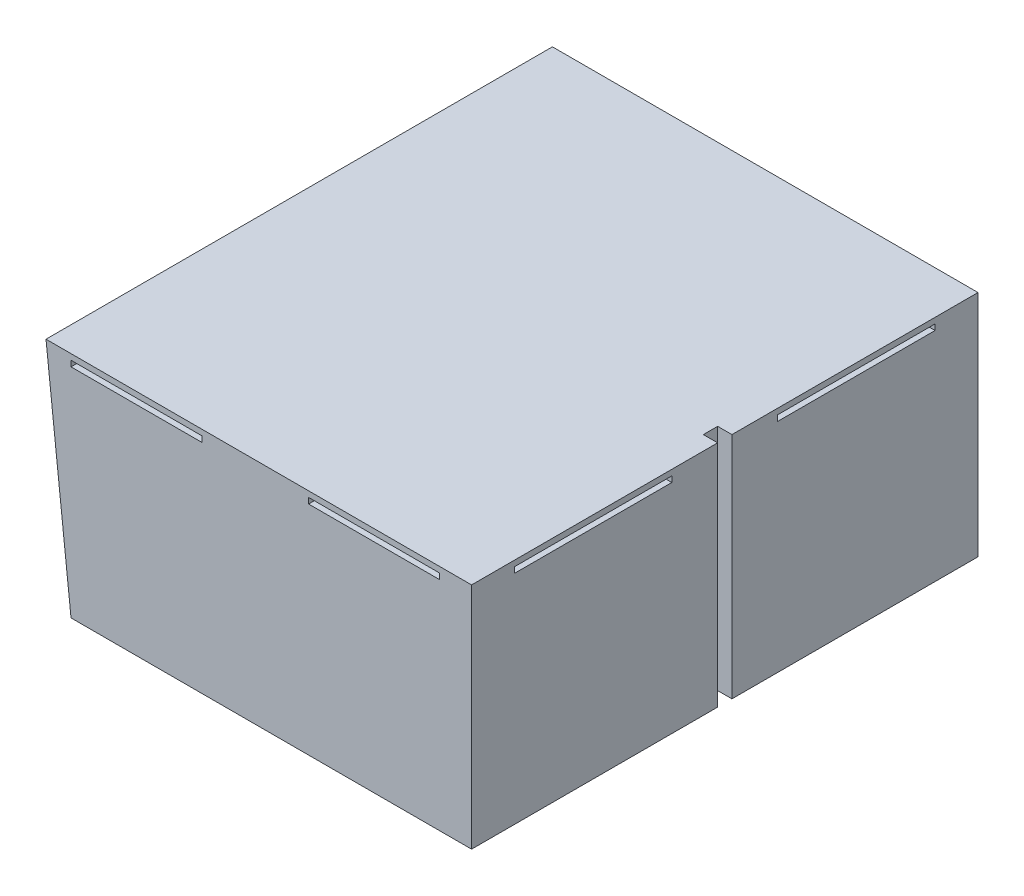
ISO-10303-21;
HEADER;
FILE_DESCRIPTION(('STEP AP214'),'2;1');
FILE_NAME('part.step','',(''),(''),'','','');
FILE_SCHEMA(('AUTOMOTIVE_DESIGN { 1 0 10303 214 1 1 1 1 }'));
ENDSEC;
DATA;
#1=APPLICATION_CONTEXT('core data for automotive mechanical design processes');
#2=APPLICATION_PROTOCOL_DEFINITION('international standard','automotive_design',2000,#1);
#3=PRODUCT_CONTEXT('',#1,'mechanical');
#4=PRODUCT('Part','Part','',(#3));
#5=PRODUCT_RELATED_PRODUCT_CATEGORY('part','',(#4));
#6=PRODUCT_DEFINITION_FORMATION('','',#4);
#7=PRODUCT_DEFINITION_CONTEXT('part definition',#1,'design');
#8=PRODUCT_DEFINITION('design','',#6,#7);
#9=PRODUCT_DEFINITION_SHAPE('','',#8);
#10=(LENGTH_UNIT() NAMED_UNIT(*) SI_UNIT(.MILLI.,.METRE.));
#11=(NAMED_UNIT(*) PLANE_ANGLE_UNIT() SI_UNIT($,.RADIAN.));
#12=(NAMED_UNIT(*) SI_UNIT($,.STERADIAN.) SOLID_ANGLE_UNIT());
#13=UNCERTAINTY_MEASURE_WITH_UNIT(LENGTH_MEASURE(1.E-05),#10,'distance_accuracy_value','');
#14=(GEOMETRIC_REPRESENTATION_CONTEXT(3) GLOBAL_UNCERTAINTY_ASSIGNED_CONTEXT((#13)) GLOBAL_UNIT_ASSIGNED_CONTEXT((#10,
#11,#12)) REPRESENTATION_CONTEXT('',''));
#15=CARTESIAN_POINT('',(0.,0.,0.));
#16=DIRECTION('',(0.,0.,1.));
#17=DIRECTION('',(1.,0.,0.));
#18=AXIS2_PLACEMENT_3D('',#15,#16,#17);
#19=CARTESIAN_POINT('',(1400.,800.,1770.));
#20=DIRECTION('',(-1.,0.,0.));
#21=DIRECTION('',(0.,0.,1.));
#22=AXIS2_PLACEMENT_3D('',#19,#20,#21);
#23=PLANE('',#22);
#24=DIRECTION('',(0.,0.,-1.));
#25=VECTOR('',#24,1.);
#26=CARTESIAN_POINT('',(1400.,760.,1620.));
#27=LINE('',#26,#25);
#28=CARTESIAN_POINT('',(1400.,760.,1620.));
#29=VERTEX_POINT('',#28);
#30=CARTESIAN_POINT('',(1400.,760.,1070.));
#31=VERTEX_POINT('',#30);
#32=EDGE_CURVE('E382',#29,#31,#27,.T.);
#33=ORIENTED_EDGE('',*,*,#32,.F.);
#34=DIRECTION('',(0.,-1.,0.));
#35=VECTOR('',#34,1.);
#36=CARTESIAN_POINT('',(1400.,780.,1620.));
#37=LINE('',#36,#35);
#38=CARTESIAN_POINT('',(1400.,780.,1620.));
#39=VERTEX_POINT('',#38);
#40=EDGE_CURVE('E380',#39,#29,#37,.T.);
#41=ORIENTED_EDGE('',*,*,#40,.F.);
#42=DIRECTION('',(0.,0.,1.));
#43=VECTOR('',#42,1.);
#44=CARTESIAN_POINT('',(1400.,780.,1620.));
#45=LINE('',#44,#43);
#46=CARTESIAN_POINT('',(1400.,780.,1070.));
#47=VERTEX_POINT('',#46);
#48=EDGE_CURVE('E388',#47,#39,#45,.T.);
#49=ORIENTED_EDGE('',*,*,#48,.F.);
#50=DIRECTION('',(0.,1.,0.));
#51=VECTOR('',#50,1.);
#52=CARTESIAN_POINT('',(1400.,780.,1070.));
#53=LINE('',#52,#51);
#54=EDGE_CURVE('E385',#31,#47,#53,.T.);
#55=ORIENTED_EDGE('',*,*,#54,.F.);
#56=EDGE_LOOP('',(#33,#41,#49,#55));
#57=FACE_BOUND('',#56,.T.);
#58=DIRECTION('',(0.,0.,-1.));
#59=VECTOR('',#58,1.);
#60=CARTESIAN_POINT('',(1400.,0.,1770.));
#61=LINE('',#60,#59);
#62=CARTESIAN_POINT('',(1400.,0.,1770.));
#63=VERTEX_POINT('',#62);
#64=CARTESIAN_POINT('',(1400.,0.,910.));
#65=VERTEX_POINT('',#64);
#66=EDGE_CURVE('E559',#63,#65,#61,.T.);
#67=ORIENTED_EDGE('',*,*,#66,.T.);
#68=DIRECTION('',(0.,-1.,0.));
#69=VECTOR('',#68,1.);
#70=CARTESIAN_POINT('',(1400.,800.,910.));
#71=LINE('',#70,#69);
#72=CARTESIAN_POINT('',(1400.,800.,910.));
#73=VERTEX_POINT('',#72);
#74=EDGE_CURVE('E294',#73,#65,#71,.T.);
#75=ORIENTED_EDGE('',*,*,#74,.F.);
#76=DIRECTION('',(0.,0.,-1.));
#77=VECTOR('',#76,1.);
#78=CARTESIAN_POINT('',(1400.,800.,1770.));
#79=LINE('',#78,#77);
#80=CARTESIAN_POINT('',(1400.,800.,1770.));
#81=VERTEX_POINT('',#80);
#82=EDGE_CURVE('E555',#81,#73,#79,.T.);
#83=ORIENTED_EDGE('',*,*,#82,.F.);
#84=DIRECTION('',(0.,1.,0.));
#85=VECTOR('',#84,1.);
#86=CARTESIAN_POINT('',(1400.,800.,1770.));
#87=LINE('',#86,#85);
#88=EDGE_CURVE('E538',#63,#81,#87,.T.);
#89=ORIENTED_EDGE('',*,*,#88,.F.);
#90=EDGE_LOOP('',(#67,#75,#83,#89));
#91=FACE_BOUND('',#90,.T.);
#92=ADVANCED_FACE('F32',(#57,#91),#23,.F.);
#93=CARTESIAN_POINT('',(0.,780.,0.));
#94=DIRECTION('',(-1.,0.,0.));
#95=DIRECTION('',(0.,-1.,0.));
#96=AXIS2_PLACEMENT_3D('',#93,#94,#95);
#97=PLANE('',#96);
#98=DIRECTION('',(0.,0.,1.));
#99=VECTOR('',#98,1.);
#100=CARTESIAN_POINT('',(0.,760.,0.));
#101=LINE('',#100,#99);
#102=CARTESIAN_POINT('',(0.,760.,700.));
#103=VERTEX_POINT('',#102);
#104=CARTESIAN_POINT('',(0.,760.,1070.));
#105=VERTEX_POINT('',#104);
#106=EDGE_CURVE('E531',#103,#105,#101,.T.);
#107=ORIENTED_EDGE('',*,*,#106,.F.);
#108=DIRECTION('',(0.,1.,0.));
#109=VECTOR('',#108,1.);
#110=CARTESIAN_POINT('',(0.,780.,700.));
#111=LINE('',#110,#109);
#112=CARTESIAN_POINT('',(0.,780.,700.));
#113=VERTEX_POINT('',#112);
#114=EDGE_CURVE('E374',#103,#113,#111,.T.);
#115=ORIENTED_EDGE('',*,*,#114,.T.);
#116=DIRECTION('',(0.,0.,1.));
#117=VECTOR('',#116,1.);
#118=CARTESIAN_POINT('',(0.,780.,0.));
#119=LINE('',#118,#117);
#120=CARTESIAN_POINT('',(0.,780.,1070.));
#121=VERTEX_POINT('',#120);
#122=EDGE_CURVE('E517',#113,#121,#119,.T.);
#123=ORIENTED_EDGE('',*,*,#122,.T.);
#124=DIRECTION('',(0.,-1.,0.));
#125=VECTOR('',#124,1.);
#126=CARTESIAN_POINT('',(0.,780.,1070.));
#127=LINE('',#126,#125);
#128=EDGE_CURVE('E417',#121,#105,#127,.T.);
#129=ORIENTED_EDGE('',*,*,#128,.T.);
#130=EDGE_LOOP('',(#107,#115,#123,#129));
#131=FACE_BOUND('',#130,.T.);
#132=ADVANCED_FACE('F658',(#131),#97,.F.);
#133=CARTESIAN_POINT('',(457.431779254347,780.,0.));
#134=DIRECTION('',(1.,0.,0.));
#135=DIRECTION('',(0.,0.,-1.));
#136=AXIS2_PLACEMENT_3D('',#133,#134,#135);
#137=PLANE('',#136);
#138=DIRECTION('',(0.,0.,1.));
#139=VECTOR('',#138,1.);
#140=CARTESIAN_POINT('',(457.431779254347,780.,0.));
#141=LINE('',#140,#139);
#142=CARTESIAN_POINT('',(457.431779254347,780.,700.));
#143=VERTEX_POINT('',#142);
#144=CARTESIAN_POINT('',(457.431779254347,780.,1070.));
#145=VERTEX_POINT('',#144);
#146=EDGE_CURVE('E522',#143,#145,#141,.T.);
#147=ORIENTED_EDGE('',*,*,#146,.F.);
#148=DIRECTION('',(0.,-1.,0.));
#149=VECTOR('',#148,1.);
#150=CARTESIAN_POINT('',(457.431779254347,780.,700.));
#151=LINE('',#150,#149);
#152=CARTESIAN_POINT('',(457.431779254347,760.,700.));
#153=VERTEX_POINT('',#152);
#154=EDGE_CURVE('E371',#143,#153,#151,.T.);
#155=ORIENTED_EDGE('',*,*,#154,.T.);
#156=DIRECTION('',(0.,0.,1.));
#157=VECTOR('',#156,1.);
#158=CARTESIAN_POINT('',(457.431779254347,760.,0.));
#159=LINE('',#158,#157);
#160=CARTESIAN_POINT('',(457.431779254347,760.,1070.));
#161=VERTEX_POINT('',#160);
#162=EDGE_CURVE('E527',#153,#161,#159,.T.);
#163=ORIENTED_EDGE('',*,*,#162,.T.);
#164=DIRECTION('',(0.,1.,0.));
#165=VECTOR('',#164,1.);
#166=CARTESIAN_POINT('',(457.431779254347,780.,1070.));
#167=LINE('',#166,#165);
#168=EDGE_CURVE('E414',#161,#145,#167,.T.);
#169=ORIENTED_EDGE('',*,*,#168,.T.);
#170=EDGE_LOOP('',(#147,#155,#163,#169));
#171=FACE_BOUND('',#170,.T.);
#172=ADVANCED_FACE('F666',(#171),#137,.F.);
#173=CARTESIAN_POINT('',(830.303739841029,780.,0.));
#174=DIRECTION('',(-1.,0.,0.));
#175=DIRECTION('',(0.,0.,1.));
#176=AXIS2_PLACEMENT_3D('',#173,#174,#175);
#177=PLANE('',#176);
#178=DIRECTION('',(0.,0.,1.));
#179=VECTOR('',#178,1.);
#180=CARTESIAN_POINT('',(830.303739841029,760.,0.));
#181=LINE('',#180,#179);
#182=CARTESIAN_POINT('',(830.303739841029,760.,700.));
#183=VERTEX_POINT('',#182);
#184=CARTESIAN_POINT('',(830.303739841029,760.,1070.));
#185=VERTEX_POINT('',#184);
#186=EDGE_CURVE('E488',#183,#185,#181,.T.);
#187=ORIENTED_EDGE('',*,*,#186,.F.);
#188=DIRECTION('',(0.,1.,0.));
#189=VECTOR('',#188,1.);
#190=CARTESIAN_POINT('',(830.303739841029,780.,700.));
#191=LINE('',#190,#189);
#192=CARTESIAN_POINT('',(830.303739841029,780.,700.));
#193=VERTEX_POINT('',#192);
#194=EDGE_CURVE('E368',#183,#193,#191,.T.);
#195=ORIENTED_EDGE('',*,*,#194,.T.);
#196=DIRECTION('',(0.,0.,1.));
#197=VECTOR('',#196,1.);
#198=CARTESIAN_POINT('',(830.303739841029,780.,0.));
#199=LINE('',#198,#197);
#200=CARTESIAN_POINT('',(830.303739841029,780.,1070.));
#201=VERTEX_POINT('',#200);
#202=EDGE_CURVE('E473',#193,#201,#199,.T.);
#203=ORIENTED_EDGE('',*,*,#202,.T.);
#204=DIRECTION('',(0.,-1.,0.));
#205=VECTOR('',#204,1.);
#206=CARTESIAN_POINT('',(830.303739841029,780.,1070.));
#207=LINE('',#206,#205);
#208=EDGE_CURVE('E411',#201,#185,#207,.T.);
#209=ORIENTED_EDGE('',*,*,#208,.T.);
#210=EDGE_LOOP('',(#187,#195,#203,#209));
#211=FACE_BOUND('',#210,.T.);
#212=ADVANCED_FACE('F618',(#211),#177,.F.);
#213=CARTESIAN_POINT('',(1287.73551909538,780.,0.));
#214=DIRECTION('',(1.,0.,0.));
#215=DIRECTION('',(0.,0.,-1.));
#216=AXIS2_PLACEMENT_3D('',#213,#214,#215);
#217=PLANE('',#216);
#218=DIRECTION('',(0.,0.,1.));
#219=VECTOR('',#218,1.);
#220=CARTESIAN_POINT('',(1287.73551909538,780.,0.));
#221=LINE('',#220,#219);
#222=CARTESIAN_POINT('',(1287.73551909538,780.,700.));
#223=VERTEX_POINT('',#222);
#224=CARTESIAN_POINT('',(1287.73551909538,780.,1070.));
#225=VERTEX_POINT('',#224);
#226=EDGE_CURVE('E478',#223,#225,#221,.T.);
#227=ORIENTED_EDGE('',*,*,#226,.F.);
#228=DIRECTION('',(0.,-1.,0.));
#229=VECTOR('',#228,1.);
#230=CARTESIAN_POINT('',(1287.73551909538,780.,700.));
#231=LINE('',#230,#229);
#232=CARTESIAN_POINT('',(1287.73551909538,760.,700.));
#233=VERTEX_POINT('',#232);
#234=EDGE_CURVE('E11',#223,#233,#231,.T.);
#235=ORIENTED_EDGE('',*,*,#234,.T.);
#236=DIRECTION('',(0.,0.,1.));
#237=VECTOR('',#236,1.);
#238=CARTESIAN_POINT('',(1287.73551909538,760.,0.));
#239=LINE('',#238,#237);
#240=CARTESIAN_POINT('',(1287.73551909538,760.,1070.));
#241=VERTEX_POINT('',#240);
#242=EDGE_CURVE('E483',#233,#241,#239,.T.);
#243=ORIENTED_EDGE('',*,*,#242,.T.);
#244=DIRECTION('',(0.,1.,0.));
#245=VECTOR('',#244,1.);
#246=CARTESIAN_POINT('',(1287.73551909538,780.,1070.));
#247=LINE('',#246,#245);
#248=EDGE_CURVE('E408',#241,#225,#247,.T.);
#249=ORIENTED_EDGE('',*,*,#248,.T.);
#250=EDGE_LOOP('',(#227,#235,#243,#249));
#251=FACE_BOUND('',#250,.T.);
#252=ADVANCED_FACE('F593',(#251),#217,.F.);
#253=CARTESIAN_POINT('',(0.,760.,1620.));
#254=VERTEX_POINT('',#253);
#255=CARTESIAN_POINT('',(0.,760.,1770.));
#256=VERTEX_POINT('',#255);
#257=EDGE_CURVE('E502',#254,#256,#101,.T.);
#258=ORIENTED_EDGE('',*,*,#257,.F.);
#259=DIRECTION('',(0.,1.,0.));
#260=VECTOR('',#259,1.);
#261=CARTESIAN_POINT('',(0.,780.,1620.));
#262=LINE('',#261,#260);
#263=CARTESIAN_POINT('',(0.,780.,1620.));
#264=VERTEX_POINT('',#263);
#265=EDGE_CURVE('E432',#254,#264,#262,.T.);
#266=ORIENTED_EDGE('',*,*,#265,.T.);
#267=CARTESIAN_POINT('',(0.,780.,1770.));
#268=VERTEX_POINT('',#267);
#269=EDGE_CURVE('E518',#264,#268,#119,.T.);
#270=ORIENTED_EDGE('',*,*,#269,.T.);
#271=DIRECTION('',(0.,-1.,0.));
#272=VECTOR('',#271,1.);
#273=CARTESIAN_POINT('',(0.,780.,1770.));
#274=LINE('',#273,#272);
#275=EDGE_CURVE('E472',#268,#256,#274,.T.);
#276=ORIENTED_EDGE('',*,*,#275,.T.);
#277=EDGE_LOOP('',(#258,#266,#270,#276));
#278=FACE_BOUND('',#277,.T.);
#279=ADVANCED_FACE('F653',(#278),#97,.F.);
#280=CARTESIAN_POINT('',(457.431779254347,780.,1620.));
#281=VERTEX_POINT('',#280);
#282=CARTESIAN_POINT('',(457.431779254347,780.,1770.));
#283=VERTEX_POINT('',#282);
#284=EDGE_CURVE('E523',#281,#283,#141,.T.);
#285=ORIENTED_EDGE('',*,*,#284,.F.);
#286=DIRECTION('',(0.,-1.,0.));
#287=VECTOR('',#286,1.);
#288=CARTESIAN_POINT('',(457.431779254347,780.,1620.));
#289=LINE('',#288,#287);
#290=CARTESIAN_POINT('',(457.431779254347,760.,1620.));
#291=VERTEX_POINT('',#290);
#292=EDGE_CURVE('E429',#281,#291,#289,.T.);
#293=ORIENTED_EDGE('',*,*,#292,.T.);
#294=CARTESIAN_POINT('',(457.431779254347,760.,1770.));
#295=VERTEX_POINT('',#294);
#296=EDGE_CURVE('E528',#291,#295,#159,.T.);
#297=ORIENTED_EDGE('',*,*,#296,.T.);
#298=DIRECTION('',(0.,1.,0.));
#299=VECTOR('',#298,1.);
#300=CARTESIAN_POINT('',(457.431779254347,780.,1770.));
#301=LINE('',#300,#299);
#302=EDGE_CURVE('E508',#295,#283,#301,.T.);
#303=ORIENTED_EDGE('',*,*,#302,.T.);
#304=EDGE_LOOP('',(#285,#293,#297,#303));
#305=FACE_BOUND('',#304,.T.);
#306=ADVANCED_FACE('F670',(#305),#137,.F.);
#307=CARTESIAN_POINT('',(830.303739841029,760.,1620.));
#308=VERTEX_POINT('',#307);
#309=CARTESIAN_POINT('',(830.303739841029,760.,1770.));
#310=VERTEX_POINT('',#309);
#311=EDGE_CURVE('E458',#308,#310,#181,.T.);
#312=ORIENTED_EDGE('',*,*,#311,.F.);
#313=DIRECTION('',(0.,1.,0.));
#314=VECTOR('',#313,1.);
#315=CARTESIAN_POINT('',(830.303739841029,780.,1620.));
#316=LINE('',#315,#314);
#317=CARTESIAN_POINT('',(830.303739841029,780.,1620.));
#318=VERTEX_POINT('',#317);
#319=EDGE_CURVE('E426',#308,#318,#316,.T.);
#320=ORIENTED_EDGE('',*,*,#319,.T.);
#321=CARTESIAN_POINT('',(830.303739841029,780.,1770.));
#322=VERTEX_POINT('',#321);
#323=EDGE_CURVE('E474',#318,#322,#199,.T.);
#324=ORIENTED_EDGE('',*,*,#323,.T.);
#325=DIRECTION('',(0.,-1.,0.));
#326=VECTOR('',#325,1.);
#327=CARTESIAN_POINT('',(830.303739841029,780.,1770.));
#328=LINE('',#327,#326);
#329=EDGE_CURVE('E444',#322,#310,#328,.T.);
#330=ORIENTED_EDGE('',*,*,#329,.T.);
#331=EDGE_LOOP('',(#312,#320,#324,#330));
#332=FACE_BOUND('',#331,.T.);
#333=ADVANCED_FACE('F611',(#332),#177,.F.);
#334=CARTESIAN_POINT('',(1287.73551909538,780.,1620.));
#335=VERTEX_POINT('',#334);
#336=CARTESIAN_POINT('',(1287.73551909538,780.,1770.));
#337=VERTEX_POINT('',#336);
#338=EDGE_CURVE('E479',#335,#337,#221,.T.);
#339=ORIENTED_EDGE('',*,*,#338,.F.);
#340=DIRECTION('',(0.,-1.,0.));
#341=VECTOR('',#340,1.);
#342=CARTESIAN_POINT('',(1287.73551909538,780.,1620.));
#343=LINE('',#342,#341);
#344=CARTESIAN_POINT('',(1287.73551909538,760.,1620.));
#345=VERTEX_POINT('',#344);
#346=EDGE_CURVE('E423',#335,#345,#343,.T.);
#347=ORIENTED_EDGE('',*,*,#346,.T.);
#348=CARTESIAN_POINT('',(1287.73551909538,760.,1770.));
#349=VERTEX_POINT('',#348);
#350=EDGE_CURVE('E484',#345,#349,#239,.T.);
#351=ORIENTED_EDGE('',*,*,#350,.T.);
#352=DIRECTION('',(0.,1.,0.));
#353=VECTOR('',#352,1.);
#354=CARTESIAN_POINT('',(1287.73551909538,780.,1770.));
#355=LINE('',#354,#353);
#356=EDGE_CURVE('E464',#349,#337,#355,.T.);
#357=ORIENTED_EDGE('',*,*,#356,.T.);
#358=EDGE_LOOP('',(#339,#347,#351,#357));
#359=FACE_BOUND('',#358,.T.);
#360=ADVANCED_FACE('F603',(#359),#217,.F.);
#361=CARTESIAN_POINT('',(0.,0.,1770.));
#362=DIRECTION('',(0.994075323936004,0.108693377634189,0.));
#363=DIRECTION('',(-0.108693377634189,0.994075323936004,0.));
#364=AXIS2_PLACEMENT_3D('',#361,#362,#363);
#365=PLANE('',#364);
#366=DIRECTION('',(0.,0.,1.));
#367=VECTOR('',#366,1.);
#368=CARTESIAN_POINT('',(-85.2861272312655,780.,1770.));
#369=LINE('',#368,#367);
#370=CARTESIAN_POINT('',(-85.2861272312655,780.,150.));
#371=VERTEX_POINT('',#370);
#372=CARTESIAN_POINT('',(-85.2861272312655,780.,700.));
#373=VERTEX_POINT('',#372);
#374=EDGE_CURVE('E365',#371,#373,#369,.T.);
#375=ORIENTED_EDGE('',*,*,#374,.T.);
#376=DIRECTION('',(0.108693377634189,-0.994075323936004,0.));
#377=VECTOR('',#376,1.);
#378=CARTESIAN_POINT('',(0.,0.,700.));
#379=LINE('',#378,#377);
#380=CARTESIAN_POINT('',(-83.0993034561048,760.,700.));
#381=VERTEX_POINT('',#380);
#382=EDGE_CURVE('E377',#373,#381,#379,.T.);
#383=ORIENTED_EDGE('',*,*,#382,.T.);
#384=DIRECTION('',(0.,0.,-1.));
#385=VECTOR('',#384,1.);
#386=CARTESIAN_POINT('',(-83.0993034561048,760.,1770.));
#387=LINE('',#386,#385);
#388=CARTESIAN_POINT('',(-83.0993034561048,760.,150.));
#389=VERTEX_POINT('',#388);
#390=EDGE_CURVE('E350',#381,#389,#387,.T.);
#391=ORIENTED_EDGE('',*,*,#390,.T.);
#392=DIRECTION('',(-0.108693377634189,0.994075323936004,0.));
#393=VECTOR('',#392,1.);
#394=CARTESIAN_POINT('',(-2.42916846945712E-13,2.22164080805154E-12,149.999999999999));
#395=LINE('',#394,#393);
#396=EDGE_CURVE('E362',#389,#371,#395,.T.);
#397=ORIENTED_EDGE('',*,*,#396,.T.);
#398=EDGE_LOOP('',(#375,#383,#391,#397));
#399=FACE_BOUND('',#398,.T.);
#400=DIRECTION('',(0.,0.,1.));
#401=VECTOR('',#400,1.);
#402=CARTESIAN_POINT('',(-85.2861272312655,780.,1770.));
#403=LINE('',#402,#401);
#404=CARTESIAN_POINT('',(-85.2861272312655,780.,1070.));
#405=VERTEX_POINT('',#404);
#406=CARTESIAN_POINT('',(-85.2861272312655,780.,1620.));
#407=VERTEX_POINT('',#406);
#408=EDGE_CURVE('E441',#405,#407,#403,.T.);
#409=ORIENTED_EDGE('',*,*,#408,.T.);
#410=DIRECTION('',(0.108693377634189,-0.994075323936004,0.));
#411=VECTOR('',#410,1.);
#412=CARTESIAN_POINT('',(0.,0.,1620.));
#413=LINE('',#412,#411);
#414=CARTESIAN_POINT('',(-83.0993034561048,760.,1620.));
#415=VERTEX_POINT('',#414);
#416=EDGE_CURVE('E435',#407,#415,#413,.T.);
#417=ORIENTED_EDGE('',*,*,#416,.T.);
#418=DIRECTION('',(0.,0.,-1.));
#419=VECTOR('',#418,1.);
#420=CARTESIAN_POINT('',(-83.0993034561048,760.,1770.));
#421=LINE('',#420,#419);
#422=CARTESIAN_POINT('',(-83.0993034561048,760.,1070.));
#423=VERTEX_POINT('',#422);
#424=EDGE_CURVE('E438',#415,#423,#421,.T.);
#425=ORIENTED_EDGE('',*,*,#424,.T.);
#426=DIRECTION('',(-0.108693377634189,0.994075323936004,0.));
#427=VECTOR('',#426,1.);
#428=CARTESIAN_POINT('',(0.,0.,1070.));
#429=LINE('',#428,#427);
#430=EDGE_CURVE('E420',#423,#405,#429,.T.);
#431=ORIENTED_EDGE('',*,*,#430,.T.);
#432=EDGE_LOOP('',(#409,#417,#425,#431));
#433=FACE_BOUND('',#432,.T.);
#434=DIRECTION('',(0.108693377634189,-0.994075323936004,0.));
#435=VECTOR('',#434,1.);
#436=CARTESIAN_POINT('',(0.,0.,0.));
#437=LINE('',#436,#435);
#438=CARTESIAN_POINT('',(-87.4729510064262,800.,0.));
#439=VERTEX_POINT('',#438);
#440=CARTESIAN_POINT('',(0.,0.,0.));
#441=VERTEX_POINT('',#440);
#442=EDGE_CURVE('E516',#439,#441,#437,.T.);
#443=ORIENTED_EDGE('',*,*,#442,.T.);
#444=DIRECTION('',(0.,0.,-1.));
#445=VECTOR('',#444,1.);
#446=CARTESIAN_POINT('',(0.,0.,1770.));
#447=LINE('',#446,#445);
#448=CARTESIAN_POINT('',(0.,0.,1770.));
#449=VERTEX_POINT('',#448);
#450=EDGE_CURVE('E561',#449,#441,#447,.T.);
#451=ORIENTED_EDGE('',*,*,#450,.F.);
#452=DIRECTION('',(0.108693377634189,-0.994075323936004,0.));
#453=VECTOR('',#452,1.);
#454=CARTESIAN_POINT('',(0.,0.,1770.));
#455=LINE('',#454,#453);
#456=CARTESIAN_POINT('',(-87.4729510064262,800.,1770.));
#457=VERTEX_POINT('',#456);
#458=EDGE_CURVE('E532',#457,#449,#455,.T.);
#459=ORIENTED_EDGE('',*,*,#458,.F.);
#460=DIRECTION('',(0.,0.,-1.));
#461=VECTOR('',#460,1.);
#462=CARTESIAN_POINT('',(-87.4729510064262,800.,1770.));
#463=LINE('',#462,#461);
#464=EDGE_CURVE('E542',#457,#439,#463,.T.);
#465=ORIENTED_EDGE('',*,*,#464,.T.);
#466=EDGE_LOOP('',(#443,#451,#459,#465));
#467=FACE_BOUND('',#466,.T.);
#468=ADVANCED_FACE('F34',(#399,#433,#467),#365,.F.);
#469=CARTESIAN_POINT('',(0.,0.,1770.));
#470=DIRECTION('',(0.,1.,0.));
#471=DIRECTION('',(0.,0.,1.));
#472=AXIS2_PLACEMENT_3D('',#469,#470,#471);
#473=PLANE('',#472);
#474=DIRECTION('',(0.,0.,-1.));
#475=VECTOR('',#474,1.);
#476=CARTESIAN_POINT('',(1350.,0.,910.));
#477=LINE('',#476,#475);
#478=CARTESIAN_POINT('',(1350.,0.,910.));
#479=VERTEX_POINT('',#478);
#480=CARTESIAN_POINT('',(1350.,0.,860.));
#481=VERTEX_POINT('',#480);
#482=EDGE_CURVE('E303',#479,#481,#477,.T.);
#483=ORIENTED_EDGE('',*,*,#482,.F.);
#484=DIRECTION('',(1.,0.,0.));
#485=VECTOR('',#484,1.);
#486=CARTESIAN_POINT('',(1350.,0.,910.));
#487=LINE('',#486,#485);
#488=EDGE_CURVE('E289',#479,#65,#487,.T.);
#489=ORIENTED_EDGE('',*,*,#488,.T.);
#490=ORIENTED_EDGE('',*,*,#66,.F.);
#491=DIRECTION('',(1.,0.,0.));
#492=VECTOR('',#491,1.);
#493=CARTESIAN_POINT('',(0.,0.,1770.));
#494=LINE('',#493,#492);
#495=EDGE_CURVE('E535',#449,#63,#494,.T.);
#496=ORIENTED_EDGE('',*,*,#495,.F.);
#497=ORIENTED_EDGE('',*,*,#450,.T.);
#498=DIRECTION('',(1.,0.,0.));
#499=VECTOR('',#498,1.);
#500=CARTESIAN_POINT('',(0.,0.,0.));
#501=LINE('',#500,#499);
#502=CARTESIAN_POINT('',(1400.,0.,0.));
#503=VERTEX_POINT('',#502);
#504=EDGE_CURVE('E545',#441,#503,#501,.T.);
#505=ORIENTED_EDGE('',*,*,#504,.T.);
#506=CARTESIAN_POINT('',(1400.,0.,860.));
#507=VERTEX_POINT('',#506);
#508=EDGE_CURVE('E558',#507,#503,#61,.T.);
#509=ORIENTED_EDGE('',*,*,#508,.F.);
#510=DIRECTION('',(1.,0.,0.));
#511=VECTOR('',#510,1.);
#512=CARTESIAN_POINT('',(1350.,0.,860.));
#513=LINE('',#512,#511);
#514=EDGE_CURVE('E299',#481,#507,#513,.T.);
#515=ORIENTED_EDGE('',*,*,#514,.F.);
#516=EDGE_LOOP('',(#483,#489,#490,#496,#497,#505,#509,#515));
#517=FACE_BOUND('',#516,.T.);
#518=ADVANCED_FACE('F309',(#517),#473,.F.);
#519=DIRECTION('',(0.,0.,-1.));
#520=VECTOR('',#519,1.);
#521=CARTESIAN_POINT('',(1400.,760.,700.));
#522=LINE('',#521,#520);
#523=CARTESIAN_POINT('',(1400.,760.,700.));
#524=VERTEX_POINT('',#523);
#525=CARTESIAN_POINT('',(1400.,760.,150.));
#526=VERTEX_POINT('',#525);
#527=EDGE_CURVE('E325',#524,#526,#522,.T.);
#528=ORIENTED_EDGE('',*,*,#527,.F.);
#529=DIRECTION('',(0.,-1.,0.));
#530=VECTOR('',#529,1.);
#531=CARTESIAN_POINT('',(1400.,780.,700.));
#532=LINE('',#531,#530);
#533=CARTESIAN_POINT('',(1400.,780.,700.));
#534=VERTEX_POINT('',#533);
#535=EDGE_CURVE('E319',#534,#524,#532,.T.);
#536=ORIENTED_EDGE('',*,*,#535,.F.);
#537=DIRECTION('',(0.,0.,1.));
#538=VECTOR('',#537,1.);
#539=CARTESIAN_POINT('',(1400.,780.,700.));
#540=LINE('',#539,#538);
#541=CARTESIAN_POINT('',(1400.,780.,150.));
#542=VERTEX_POINT('',#541);
#543=EDGE_CURVE('E331',#542,#534,#540,.T.);
#544=ORIENTED_EDGE('',*,*,#543,.F.);
#545=DIRECTION('',(0.,1.,0.));
#546=VECTOR('',#545,1.);
#547=CARTESIAN_POINT('',(1400.,780.,150.));
#548=LINE('',#547,#546);
#549=EDGE_CURVE('E328',#526,#542,#548,.T.);
#550=ORIENTED_EDGE('',*,*,#549,.F.);
#551=EDGE_LOOP('',(#528,#536,#544,#550));
#552=FACE_BOUND('',#551,.T.);
#553=CARTESIAN_POINT('',(1400.,800.,860.));
#554=VERTEX_POINT('',#553);
#555=CARTESIAN_POINT('',(1400.,800.,0.));
#556=VERTEX_POINT('',#555);
#557=EDGE_CURVE('E554',#554,#556,#79,.T.);
#558=ORIENTED_EDGE('',*,*,#557,.F.);
#559=DIRECTION('',(0.,1.,0.));
#560=VECTOR('',#559,1.);
#561=CARTESIAN_POINT('',(1400.,800.,860.));
#562=LINE('',#561,#560);
#563=EDGE_CURVE('E307',#507,#554,#562,.T.);
#564=ORIENTED_EDGE('',*,*,#563,.F.);
#565=ORIENTED_EDGE('',*,*,#508,.T.);
#566=DIRECTION('',(0.,1.,0.));
#567=VECTOR('',#566,1.);
#568=CARTESIAN_POINT('',(1400.,800.,0.));
#569=LINE('',#568,#567);
#570=EDGE_CURVE('E548',#503,#556,#569,.T.);
#571=ORIENTED_EDGE('',*,*,#570,.T.);
#572=EDGE_LOOP('',(#558,#564,#565,#571));
#573=FACE_BOUND('',#572,.T.);
#574=ADVANCED_FACE('F586',(#552,#573),#23,.F.);
#575=CARTESIAN_POINT('',(-87.4729510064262,800.,1770.));
#576=DIRECTION('',(0.,-1.,0.));
#577=DIRECTION('',(0.,0.,-1.));
#578=AXIS2_PLACEMENT_3D('',#575,#576,#577);
#579=PLANE('',#578);
#580=ORIENTED_EDGE('',*,*,#82,.T.);
#581=DIRECTION('',(1.,0.,0.));
#582=VECTOR('',#581,1.);
#583=CARTESIAN_POINT('',(1350.,800.,910.));
#584=LINE('',#583,#582);
#585=CARTESIAN_POINT('',(1350.,800.,910.));
#586=VERTEX_POINT('',#585);
#587=EDGE_CURVE('E317',#586,#73,#584,.T.);
#588=ORIENTED_EDGE('',*,*,#587,.F.);
#589=DIRECTION('',(0.,0.,1.));
#590=VECTOR('',#589,1.);
#591=CARTESIAN_POINT('',(1350.,800.,910.));
#592=LINE('',#591,#590);
#593=CARTESIAN_POINT('',(1350.,800.,860.));
#594=VERTEX_POINT('',#593);
#595=EDGE_CURVE('E300',#594,#586,#592,.T.);
#596=ORIENTED_EDGE('',*,*,#595,.F.);
#597=DIRECTION('',(1.,0.,0.));
#598=VECTOR('',#597,1.);
#599=CARTESIAN_POINT('',(1350.,800.,860.));
#600=LINE('',#599,#598);
#601=EDGE_CURVE('E320',#594,#554,#600,.T.);
#602=ORIENTED_EDGE('',*,*,#601,.T.);
#603=ORIENTED_EDGE('',*,*,#557,.T.);
#604=DIRECTION('',(-1.,0.,0.));
#605=VECTOR('',#604,1.);
#606=CARTESIAN_POINT('',(-87.4729510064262,800.,0.));
#607=LINE('',#606,#605);
#608=EDGE_CURVE('E536',#556,#439,#607,.T.);
#609=ORIENTED_EDGE('',*,*,#608,.T.);
#610=ORIENTED_EDGE('',*,*,#464,.F.);
#611=DIRECTION('',(-1.,0.,0.));
#612=VECTOR('',#611,1.);
#613=CARTESIAN_POINT('',(-87.4729510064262,800.,1770.));
#614=LINE('',#613,#612);
#615=EDGE_CURVE('E540',#81,#457,#614,.T.);
#616=ORIENTED_EDGE('',*,*,#615,.F.);
#617=EDGE_LOOP('',(#580,#588,#596,#602,#603,#609,#610,#616));
#618=FACE_BOUND('',#617,.T.);
#619=ADVANCED_FACE('F697',(#618),#579,.F.);
#620=CARTESIAN_POINT('',(0.,0.,1770.));
#621=DIRECTION('',(0.,0.,-1.));
#622=DIRECTION('',(-1.,0.,0.));
#623=AXIS2_PLACEMENT_3D('',#620,#621,#622);
#624=PLANE('',#623);
#625=DIRECTION('',(1.,0.,0.));
#626=VECTOR('',#625,1.);
#627=CARTESIAN_POINT('',(830.303739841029,760.,1770.));
#628=LINE('',#627,#626);
#629=EDGE_CURVE('E461',#310,#349,#628,.T.);
#630=ORIENTED_EDGE('',*,*,#629,.F.);
#631=ORIENTED_EDGE('',*,*,#329,.F.);
#632=DIRECTION('',(-1.,0.,0.));
#633=VECTOR('',#632,1.);
#634=CARTESIAN_POINT('',(830.303739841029,780.,1770.));
#635=LINE('',#634,#633);
#636=EDGE_CURVE('E449',#337,#322,#635,.T.);
#637=ORIENTED_EDGE('',*,*,#636,.F.);
#638=ORIENTED_EDGE('',*,*,#356,.F.);
#639=EDGE_LOOP('',(#630,#631,#637,#638));
#640=FACE_BOUND('',#639,.T.);
#641=DIRECTION('',(1.,0.,0.));
#642=VECTOR('',#641,1.);
#643=CARTESIAN_POINT('',(0.,760.,1770.));
#644=LINE('',#643,#642);
#645=EDGE_CURVE('E505',#256,#295,#644,.T.);
#646=ORIENTED_EDGE('',*,*,#645,.F.);
#647=ORIENTED_EDGE('',*,*,#275,.F.);
#648=DIRECTION('',(-1.,0.,0.));
#649=VECTOR('',#648,1.);
#650=CARTESIAN_POINT('',(0.,780.,1770.));
#651=LINE('',#650,#649);
#652=EDGE_CURVE('E493',#283,#268,#651,.T.);
#653=ORIENTED_EDGE('',*,*,#652,.F.);
#654=ORIENTED_EDGE('',*,*,#302,.F.);
#655=EDGE_LOOP('',(#646,#647,#653,#654));
#656=FACE_BOUND('',#655,.T.);
#657=ORIENTED_EDGE('',*,*,#458,.T.);
#658=ORIENTED_EDGE('',*,*,#495,.T.);
#659=ORIENTED_EDGE('',*,*,#88,.T.);
#660=ORIENTED_EDGE('',*,*,#615,.T.);
#661=EDGE_LOOP('',(#657,#658,#659,#660));
#662=FACE_BOUND('',#661,.T.);
#663=ADVANCED_FACE('F607',(#640,#656,#662),#624,.F.);
#664=CARTESIAN_POINT('',(0.,0.,0.));
#665=DIRECTION('',(0.,0.,-1.));
#666=DIRECTION('',(-1.,0.,0.));
#667=AXIS2_PLACEMENT_3D('',#664,#665,#666);
#668=PLANE('',#667);
#669=DIRECTION('',(0.,-1.,0.));
#670=VECTOR('',#669,1.);
#671=CARTESIAN_POINT('',(830.303739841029,780.,0.));
#672=LINE('',#671,#670);
#673=CARTESIAN_POINT('',(830.303739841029,780.,0.));
#674=VERTEX_POINT('',#673);
#675=CARTESIAN_POINT('',(830.303739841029,760.,0.));
#676=VERTEX_POINT('',#675);
#677=EDGE_CURVE('E445',#674,#676,#672,.T.);
#678=ORIENTED_EDGE('',*,*,#677,.T.);
#679=DIRECTION('',(1.,0.,0.));
#680=VECTOR('',#679,1.);
#681=CARTESIAN_POINT('',(830.303739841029,760.,0.));
#682=LINE('',#681,#680);
#683=CARTESIAN_POINT('',(1287.73551909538,760.,0.));
#684=VERTEX_POINT('',#683);
#685=EDGE_CURVE('E448',#676,#684,#682,.T.);
#686=ORIENTED_EDGE('',*,*,#685,.T.);
#687=DIRECTION('',(0.,1.,0.));
#688=VECTOR('',#687,1.);
#689=CARTESIAN_POINT('',(1287.73551909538,780.,0.));
#690=LINE('',#689,#688);
#691=CARTESIAN_POINT('',(1287.73551909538,780.,0.));
#692=VERTEX_POINT('',#691);
#693=EDGE_CURVE('E452',#684,#692,#690,.T.);
#694=ORIENTED_EDGE('',*,*,#693,.T.);
#695=DIRECTION('',(-1.,0.,0.));
#696=VECTOR('',#695,1.);
#697=CARTESIAN_POINT('',(830.303739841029,780.,0.));
#698=LINE('',#697,#696);
#699=EDGE_CURVE('E455',#692,#674,#698,.T.);
#700=ORIENTED_EDGE('',*,*,#699,.T.);
#701=EDGE_LOOP('',(#678,#686,#694,#700));
#702=FACE_BOUND('',#701,.T.);
#703=DIRECTION('',(0.,-1.,0.));
#704=VECTOR('',#703,1.);
#705=CARTESIAN_POINT('',(0.,780.,0.));
#706=LINE('',#705,#704);
#707=CARTESIAN_POINT('',(0.,780.,0.));
#708=VERTEX_POINT('',#707);
#709=CARTESIAN_POINT('',(0.,760.,0.));
#710=VERTEX_POINT('',#709);
#711=EDGE_CURVE('E489',#708,#710,#706,.T.);
#712=ORIENTED_EDGE('',*,*,#711,.T.);
#713=DIRECTION('',(1.,0.,0.));
#714=VECTOR('',#713,1.);
#715=CARTESIAN_POINT('',(0.,760.,0.));
#716=LINE('',#715,#714);
#717=CARTESIAN_POINT('',(457.431779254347,760.,0.));
#718=VERTEX_POINT('',#717);
#719=EDGE_CURVE('E492',#710,#718,#716,.T.);
#720=ORIENTED_EDGE('',*,*,#719,.T.);
#721=DIRECTION('',(0.,1.,0.));
#722=VECTOR('',#721,1.);
#723=CARTESIAN_POINT('',(457.431779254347,780.,0.));
#724=LINE('',#723,#722);
#725=CARTESIAN_POINT('',(457.431779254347,780.,0.));
#726=VERTEX_POINT('',#725);
#727=EDGE_CURVE('E496',#718,#726,#724,.T.);
#728=ORIENTED_EDGE('',*,*,#727,.T.);
#729=DIRECTION('',(-1.,0.,0.));
#730=VECTOR('',#729,1.);
#731=CARTESIAN_POINT('',(0.,780.,0.));
#732=LINE('',#731,#730);
#733=EDGE_CURVE('E499',#726,#708,#732,.T.);
#734=ORIENTED_EDGE('',*,*,#733,.T.);
#735=EDGE_LOOP('',(#712,#720,#728,#734));
#736=FACE_BOUND('',#735,.T.);
#737=ORIENTED_EDGE('',*,*,#442,.F.);
#738=ORIENTED_EDGE('',*,*,#608,.F.);
#739=ORIENTED_EDGE('',*,*,#570,.F.);
#740=ORIENTED_EDGE('',*,*,#504,.F.);
#741=EDGE_LOOP('',(#737,#738,#739,#740));
#742=FACE_BOUND('',#741,.T.);
#743=ADVANCED_FACE('F575',(#702,#736,#742),#668,.T.);
#744=CARTESIAN_POINT('',(0.,780.,150.));
#745=VERTEX_POINT('',#744);
#746=EDGE_CURVE('E513',#708,#745,#119,.T.);
#747=ORIENTED_EDGE('',*,*,#746,.T.);
#748=DIRECTION('',(0.,-1.,0.));
#749=VECTOR('',#748,1.);
#750=CARTESIAN_POINT('',(0.,780.,150.));
#751=LINE('',#750,#749);
#752=CARTESIAN_POINT('',(0.,760.,150.));
#753=VERTEX_POINT('',#752);
#754=EDGE_CURVE('E359',#745,#753,#751,.T.);
#755=ORIENTED_EDGE('',*,*,#754,.T.);
#756=EDGE_CURVE('E529',#710,#753,#101,.T.);
#757=ORIENTED_EDGE('',*,*,#756,.F.);
#758=ORIENTED_EDGE('',*,*,#711,.F.);
#759=EDGE_LOOP('',(#747,#755,#757,#758));
#760=FACE_BOUND('',#759,.T.);
#761=ADVANCED_FACE('F692',(#760),#97,.F.);
#762=CARTESIAN_POINT('',(0.,780.,0.));
#763=DIRECTION('',(0.,1.,0.));
#764=DIRECTION('',(0.,0.,1.));
#765=AXIS2_PLACEMENT_3D('',#762,#763,#764);
#766=PLANE('',#765);
#767=DIRECTION('',(1.,0.,0.));
#768=VECTOR('',#767,1.);
#769=CARTESIAN_POINT('',(-87.4729510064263,780.,700.));
#770=LINE('',#769,#768);
#771=EDGE_CURVE('E337',#143,#193,#770,.T.);
#772=ORIENTED_EDGE('',*,*,#771,.F.);
#773=ORIENTED_EDGE('',*,*,#146,.T.);
#774=DIRECTION('',(1.,0.,0.));
#775=VECTOR('',#774,1.);
#776=CARTESIAN_POINT('',(-87.4729510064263,780.,1070.));
#777=LINE('',#776,#775);
#778=EDGE_CURVE('E399',#145,#201,#777,.T.);
#779=ORIENTED_EDGE('',*,*,#778,.T.);
#780=ORIENTED_EDGE('',*,*,#202,.F.);
#781=EDGE_LOOP('',(#772,#773,#779,#780));
#782=FACE_BOUND('',#781,.T.);
#783=CARTESIAN_POINT('',(457.431779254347,780.,150.));
#784=VERTEX_POINT('',#783);
#785=EDGE_CURVE('E519',#726,#784,#141,.T.);
#786=ORIENTED_EDGE('',*,*,#785,.T.);
#787=DIRECTION('',(1.,0.,0.));
#788=VECTOR('',#787,1.);
#789=CARTESIAN_POINT('',(-87.4729510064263,780.,150.));
#790=LINE('',#789,#788);
#791=CARTESIAN_POINT('',(830.303739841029,780.,150.));
#792=VERTEX_POINT('',#791);
#793=EDGE_CURVE('E342',#784,#792,#790,.T.);
#794=ORIENTED_EDGE('',*,*,#793,.T.);
#795=EDGE_CURVE('E469',#674,#792,#199,.T.);
#796=ORIENTED_EDGE('',*,*,#795,.F.);
#797=ORIENTED_EDGE('',*,*,#699,.F.);
#798=CARTESIAN_POINT('',(1287.73551909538,780.,150.));
#799=VERTEX_POINT('',#798);
#800=EDGE_CURVE('E475',#692,#799,#221,.T.);
#801=ORIENTED_EDGE('',*,*,#800,.T.);
#802=EDGE_CURVE('E340',#799,#542,#790,.T.);
#803=ORIENTED_EDGE('',*,*,#802,.T.);
#804=ORIENTED_EDGE('',*,*,#543,.T.);
#805=EDGE_CURVE('E335',#223,#534,#770,.T.);
#806=ORIENTED_EDGE('',*,*,#805,.F.);
#807=ORIENTED_EDGE('',*,*,#226,.T.);
#808=EDGE_CURVE('E397',#225,#47,#777,.T.);
#809=ORIENTED_EDGE('',*,*,#808,.T.);
#810=ORIENTED_EDGE('',*,*,#48,.T.);
#811=DIRECTION('',(1.,0.,0.));
#812=VECTOR('',#811,1.);
#813=CARTESIAN_POINT('',(-87.4729510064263,780.,1620.));
#814=LINE('',#813,#812);
#815=EDGE_CURVE('E392',#335,#39,#814,.T.);
#816=ORIENTED_EDGE('',*,*,#815,.F.);
#817=ORIENTED_EDGE('',*,*,#338,.T.);
#818=ORIENTED_EDGE('',*,*,#636,.T.);
#819=ORIENTED_EDGE('',*,*,#323,.F.);
#820=EDGE_CURVE('E394',#281,#318,#814,.T.);
#821=ORIENTED_EDGE('',*,*,#820,.F.);
#822=ORIENTED_EDGE('',*,*,#284,.T.);
#823=ORIENTED_EDGE('',*,*,#652,.T.);
#824=ORIENTED_EDGE('',*,*,#269,.F.);
#825=EDGE_CURVE('E396',#407,#264,#814,.T.);
#826=ORIENTED_EDGE('',*,*,#825,.F.);
#827=ORIENTED_EDGE('',*,*,#408,.F.);
#828=EDGE_CURVE('E395',#405,#121,#777,.T.);
#829=ORIENTED_EDGE('',*,*,#828,.T.);
#830=ORIENTED_EDGE('',*,*,#122,.F.);
#831=EDGE_CURVE('E339',#373,#113,#770,.T.);
#832=ORIENTED_EDGE('',*,*,#831,.F.);
#833=ORIENTED_EDGE('',*,*,#374,.F.);
#834=EDGE_CURVE('E338',#371,#745,#790,.T.);
#835=ORIENTED_EDGE('',*,*,#834,.T.);
#836=ORIENTED_EDGE('',*,*,#746,.F.);
#837=ORIENTED_EDGE('',*,*,#733,.F.);
#838=EDGE_LOOP('',(#786,#794,#796,#797,#801,#803,#804,#806,#807,#809,#810,#816,#817,#818,#819,
#821,#822,#823,#824,#826,#827,#829,#830,#832,#833,#835,#836,#837));
#839=FACE_BOUND('',#838,.T.);
#840=ADVANCED_FACE('F571',(#782,#839),#766,.F.);
#841=CARTESIAN_POINT('',(457.431779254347,760.,150.));
#842=VERTEX_POINT('',#841);
#843=EDGE_CURVE('E524',#718,#842,#159,.T.);
#844=ORIENTED_EDGE('',*,*,#843,.T.);
#845=DIRECTION('',(0.,1.,0.));
#846=VECTOR('',#845,1.);
#847=CARTESIAN_POINT('',(457.431779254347,780.,150.));
#848=LINE('',#847,#846);
#849=EDGE_CURVE('E356',#842,#784,#848,.T.);
#850=ORIENTED_EDGE('',*,*,#849,.T.);
#851=ORIENTED_EDGE('',*,*,#785,.F.);
#852=ORIENTED_EDGE('',*,*,#727,.F.);
#853=EDGE_LOOP('',(#844,#850,#851,#852));
#854=FACE_BOUND('',#853,.T.);
#855=ADVANCED_FACE('F675',(#854),#137,.F.);
#856=CARTESIAN_POINT('',(0.,760.,0.));
#857=DIRECTION('',(0.,-1.,0.));
#858=DIRECTION('',(0.,0.,-1.));
#859=AXIS2_PLACEMENT_3D('',#856,#857,#858);
#860=PLANE('',#859);
#861=DIRECTION('',(1.,0.,0.));
#862=VECTOR('',#861,1.);
#863=CARTESIAN_POINT('',(-87.4729510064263,760.,150.));
#864=LINE('',#863,#862);
#865=CARTESIAN_POINT('',(830.303739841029,760.,150.));
#866=VERTEX_POINT('',#865);
#867=EDGE_CURVE('E345',#842,#866,#864,.T.);
#868=ORIENTED_EDGE('',*,*,#867,.F.);
#869=ORIENTED_EDGE('',*,*,#843,.F.);
#870=ORIENTED_EDGE('',*,*,#719,.F.);
#871=ORIENTED_EDGE('',*,*,#756,.T.);
#872=EDGE_CURVE('E55',#389,#753,#864,.T.);
#873=ORIENTED_EDGE('',*,*,#872,.F.);
#874=ORIENTED_EDGE('',*,*,#390,.F.);
#875=DIRECTION('',(1.,0.,0.));
#876=VECTOR('',#875,1.);
#877=CARTESIAN_POINT('',(-87.4729510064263,760.,700.));
#878=LINE('',#877,#876);
#879=EDGE_CURVE('E346',#381,#103,#878,.T.);
#880=ORIENTED_EDGE('',*,*,#879,.T.);
#881=ORIENTED_EDGE('',*,*,#106,.T.);
#882=DIRECTION('',(1.,0.,0.));
#883=VECTOR('',#882,1.);
#884=CARTESIAN_POINT('',(-87.4729510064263,760.,1070.));
#885=LINE('',#884,#883);
#886=EDGE_CURVE('E400',#423,#105,#885,.T.);
#887=ORIENTED_EDGE('',*,*,#886,.F.);
#888=ORIENTED_EDGE('',*,*,#424,.F.);
#889=DIRECTION('',(1.,0.,0.));
#890=VECTOR('',#889,1.);
#891=CARTESIAN_POINT('',(-87.4729510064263,760.,1620.));
#892=LINE('',#891,#890);
#893=EDGE_CURVE('E404',#415,#254,#892,.T.);
#894=ORIENTED_EDGE('',*,*,#893,.T.);
#895=ORIENTED_EDGE('',*,*,#257,.T.);
#896=ORIENTED_EDGE('',*,*,#645,.T.);
#897=ORIENTED_EDGE('',*,*,#296,.F.);
#898=EDGE_CURVE('E407',#291,#308,#892,.T.);
#899=ORIENTED_EDGE('',*,*,#898,.T.);
#900=ORIENTED_EDGE('',*,*,#311,.T.);
#901=ORIENTED_EDGE('',*,*,#629,.T.);
#902=ORIENTED_EDGE('',*,*,#350,.F.);
#903=EDGE_CURVE('E391',#345,#29,#892,.T.);
#904=ORIENTED_EDGE('',*,*,#903,.T.);
#905=ORIENTED_EDGE('',*,*,#32,.T.);
#906=EDGE_CURVE('E401',#241,#31,#885,.T.);
#907=ORIENTED_EDGE('',*,*,#906,.F.);
#908=ORIENTED_EDGE('',*,*,#242,.F.);
#909=EDGE_CURVE('E334',#233,#524,#878,.T.);
#910=ORIENTED_EDGE('',*,*,#909,.T.);
#911=ORIENTED_EDGE('',*,*,#527,.T.);
#912=CARTESIAN_POINT('',(1287.73551909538,760.,150.));
#913=VERTEX_POINT('',#912);
#914=EDGE_CURVE('E343',#913,#526,#864,.T.);
#915=ORIENTED_EDGE('',*,*,#914,.F.);
#916=EDGE_CURVE('E480',#684,#913,#239,.T.);
#917=ORIENTED_EDGE('',*,*,#916,.F.);
#918=ORIENTED_EDGE('',*,*,#685,.F.);
#919=EDGE_CURVE('E485',#676,#866,#181,.T.);
#920=ORIENTED_EDGE('',*,*,#919,.T.);
#921=EDGE_LOOP('',(#868,#869,#870,#871,#873,#874,#880,#881,#887,#888,#894,#895,#896,#897,#899,
#900,#901,#902,#904,#905,#907,#908,#910,#911,#915,#917,#918,#920));
#922=FACE_BOUND('',#921,.T.);
#923=ORIENTED_EDGE('',*,*,#162,.F.);
#924=EDGE_CURVE('E349',#153,#183,#878,.T.);
#925=ORIENTED_EDGE('',*,*,#924,.T.);
#926=ORIENTED_EDGE('',*,*,#186,.T.);
#927=EDGE_CURVE('E403',#161,#185,#885,.T.);
#928=ORIENTED_EDGE('',*,*,#927,.F.);
#929=EDGE_LOOP('',(#923,#925,#926,#928));
#930=FACE_BOUND('',#929,.T.);
#931=ADVANCED_FACE('F578',(#922,#930),#860,.F.);
#932=ORIENTED_EDGE('',*,*,#795,.T.);
#933=DIRECTION('',(0.,-1.,0.));
#934=VECTOR('',#933,1.);
#935=CARTESIAN_POINT('',(830.303739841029,780.,150.));
#936=LINE('',#935,#934);
#937=EDGE_CURVE('E353',#792,#866,#936,.T.);
#938=ORIENTED_EDGE('',*,*,#937,.T.);
#939=ORIENTED_EDGE('',*,*,#919,.F.);
#940=ORIENTED_EDGE('',*,*,#677,.F.);
#941=EDGE_LOOP('',(#932,#938,#939,#940));
#942=FACE_BOUND('',#941,.T.);
#943=ADVANCED_FACE('F674',(#942),#177,.F.);
#944=ORIENTED_EDGE('',*,*,#916,.T.);
#945=DIRECTION('',(0.,1.,0.));
#946=VECTOR('',#945,1.);
#947=CARTESIAN_POINT('',(1287.73551909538,780.,150.));
#948=LINE('',#947,#946);
#949=EDGE_CURVE('E40',#913,#799,#948,.T.);
#950=ORIENTED_EDGE('',*,*,#949,.T.);
#951=ORIENTED_EDGE('',*,*,#800,.F.);
#952=ORIENTED_EDGE('',*,*,#693,.F.);
#953=EDGE_LOOP('',(#944,#950,#951,#952));
#954=FACE_BOUND('',#953,.T.);
#955=ADVANCED_FACE('F566',(#954),#217,.F.);
#956=CARTESIAN_POINT('',(-87.4729510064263,780.,1070.));
#957=DIRECTION('',(0.,0.,-1.));
#958=DIRECTION('',(-1.,0.,0.));
#959=AXIS2_PLACEMENT_3D('',#956,#957,#958);
#960=PLANE('',#959);
#961=ORIENTED_EDGE('',*,*,#906,.T.);
#962=ORIENTED_EDGE('',*,*,#54,.T.);
#963=ORIENTED_EDGE('',*,*,#808,.F.);
#964=ORIENTED_EDGE('',*,*,#248,.F.);
#965=EDGE_LOOP('',(#961,#962,#963,#964));
#966=FACE_BOUND('',#965,.T.);
#967=ADVANCED_FACE('F742',(#966),#960,.F.);
#968=CARTESIAN_POINT('',(-87.4729510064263,780.,1620.));
#969=DIRECTION('',(0.,0.,1.));
#970=DIRECTION('',(1.,0.,0.));
#971=AXIS2_PLACEMENT_3D('',#968,#969,#970);
#972=PLANE('',#971);
#973=ORIENTED_EDGE('',*,*,#815,.T.);
#974=ORIENTED_EDGE('',*,*,#40,.T.);
#975=ORIENTED_EDGE('',*,*,#903,.F.);
#976=ORIENTED_EDGE('',*,*,#346,.F.);
#977=EDGE_LOOP('',(#973,#974,#975,#976));
#978=FACE_BOUND('',#977,.T.);
#979=ADVANCED_FACE('F746',(#978),#972,.F.);
#980=ORIENTED_EDGE('',*,*,#927,.T.);
#981=ORIENTED_EDGE('',*,*,#208,.F.);
#982=ORIENTED_EDGE('',*,*,#778,.F.);
#983=ORIENTED_EDGE('',*,*,#168,.F.);
#984=EDGE_LOOP('',(#980,#981,#982,#983));
#985=FACE_BOUND('',#984,.T.);
#986=ADVANCED_FACE('F626',(#985),#960,.F.);
#987=ORIENTED_EDGE('',*,*,#820,.T.);
#988=ORIENTED_EDGE('',*,*,#319,.F.);
#989=ORIENTED_EDGE('',*,*,#898,.F.);
#990=ORIENTED_EDGE('',*,*,#292,.F.);
#991=EDGE_LOOP('',(#987,#988,#989,#990));
#992=FACE_BOUND('',#991,.T.);
#993=ADVANCED_FACE('F649',(#992),#972,.F.);
#994=ORIENTED_EDGE('',*,*,#825,.T.);
#995=ORIENTED_EDGE('',*,*,#265,.F.);
#996=ORIENTED_EDGE('',*,*,#893,.F.);
#997=ORIENTED_EDGE('',*,*,#416,.F.);
#998=EDGE_LOOP('',(#994,#995,#996,#997));
#999=FACE_BOUND('',#998,.T.);
#1000=ADVANCED_FACE('F645',(#999),#972,.F.);
#1001=ORIENTED_EDGE('',*,*,#886,.T.);
#1002=ORIENTED_EDGE('',*,*,#128,.F.);
#1003=ORIENTED_EDGE('',*,*,#828,.F.);
#1004=ORIENTED_EDGE('',*,*,#430,.F.);
#1005=EDGE_LOOP('',(#1001,#1002,#1003,#1004));
#1006=FACE_BOUND('',#1005,.T.);
#1007=ADVANCED_FACE('F639',(#1006),#960,.F.);
#1008=CARTESIAN_POINT('',(-87.4729510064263,780.,150.));
#1009=DIRECTION('',(0.,0.,-1.));
#1010=DIRECTION('',(0.,1.,0.));
#1011=AXIS2_PLACEMENT_3D('',#1008,#1009,#1010);
#1012=PLANE('',#1011);
#1013=ORIENTED_EDGE('',*,*,#914,.T.);
#1014=ORIENTED_EDGE('',*,*,#549,.T.);
#1015=ORIENTED_EDGE('',*,*,#802,.F.);
#1016=ORIENTED_EDGE('',*,*,#949,.F.);
#1017=EDGE_LOOP('',(#1013,#1014,#1015,#1016));
#1018=FACE_BOUND('',#1017,.T.);
#1019=ADVANCED_FACE('F582',(#1018),#1012,.F.);
#1020=CARTESIAN_POINT('',(-87.4729510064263,780.,700.));
#1021=DIRECTION('',(0.,0.,1.));
#1022=DIRECTION('',(1.,0.,0.));
#1023=AXIS2_PLACEMENT_3D('',#1020,#1021,#1022);
#1024=PLANE('',#1023);
#1025=ORIENTED_EDGE('',*,*,#805,.T.);
#1026=ORIENTED_EDGE('',*,*,#535,.T.);
#1027=ORIENTED_EDGE('',*,*,#909,.F.);
#1028=ORIENTED_EDGE('',*,*,#234,.F.);
#1029=EDGE_LOOP('',(#1025,#1026,#1027,#1028));
#1030=FACE_BOUND('',#1029,.T.);
#1031=ADVANCED_FACE('F774',(#1030),#1024,.F.);
#1032=ORIENTED_EDGE('',*,*,#867,.T.);
#1033=ORIENTED_EDGE('',*,*,#937,.F.);
#1034=ORIENTED_EDGE('',*,*,#793,.F.);
#1035=ORIENTED_EDGE('',*,*,#849,.F.);
#1036=EDGE_LOOP('',(#1032,#1033,#1034,#1035));
#1037=FACE_BOUND('',#1036,.T.);
#1038=ADVANCED_FACE('F720',(#1037),#1012,.F.);
#1039=ORIENTED_EDGE('',*,*,#771,.T.);
#1040=ORIENTED_EDGE('',*,*,#194,.F.);
#1041=ORIENTED_EDGE('',*,*,#924,.F.);
#1042=ORIENTED_EDGE('',*,*,#154,.F.);
#1043=EDGE_LOOP('',(#1039,#1040,#1041,#1042));
#1044=FACE_BOUND('',#1043,.T.);
#1045=ADVANCED_FACE('F664',(#1044),#1024,.F.);
#1046=ORIENTED_EDGE('',*,*,#831,.T.);
#1047=ORIENTED_EDGE('',*,*,#114,.F.);
#1048=ORIENTED_EDGE('',*,*,#879,.F.);
#1049=ORIENTED_EDGE('',*,*,#382,.F.);
#1050=EDGE_LOOP('',(#1046,#1047,#1048,#1049));
#1051=FACE_BOUND('',#1050,.T.);
#1052=ADVANCED_FACE('F662',(#1051),#1024,.F.);
#1053=ORIENTED_EDGE('',*,*,#872,.T.);
#1054=ORIENTED_EDGE('',*,*,#754,.F.);
#1055=ORIENTED_EDGE('',*,*,#834,.F.);
#1056=ORIENTED_EDGE('',*,*,#396,.F.);
#1057=EDGE_LOOP('',(#1053,#1054,#1055,#1056));
#1058=FACE_BOUND('',#1057,.T.);
#1059=ADVANCED_FACE('F714',(#1058),#1012,.F.);
#1060=CARTESIAN_POINT('',(1350.,800.,910.));
#1061=DIRECTION('',(0.,0.,1.));
#1062=DIRECTION('',(0.,-1.,0.));
#1063=AXIS2_PLACEMENT_3D('',#1060,#1061,#1062);
#1064=PLANE('',#1063);
#1065=ORIENTED_EDGE('',*,*,#74,.T.);
#1066=ORIENTED_EDGE('',*,*,#488,.F.);
#1067=DIRECTION('',(0.,-1.,0.));
#1068=VECTOR('',#1067,1.);
#1069=CARTESIAN_POINT('',(1350.,800.,910.));
#1070=LINE('',#1069,#1068);
#1071=EDGE_CURVE('E292',#586,#479,#1070,.T.);
#1072=ORIENTED_EDGE('',*,*,#1071,.F.);
#1073=ORIENTED_EDGE('',*,*,#587,.T.);
#1074=EDGE_LOOP('',(#1065,#1066,#1072,#1073));
#1075=FACE_BOUND('',#1074,.T.);
#1076=ADVANCED_FACE('F291',(#1075),#1064,.F.);
#1077=CARTESIAN_POINT('',(1350.,800.,860.));
#1078=DIRECTION('',(0.,0.,-1.));
#1079=DIRECTION('',(0.,1.,0.));
#1080=AXIS2_PLACEMENT_3D('',#1077,#1078,#1079);
#1081=PLANE('',#1080);
#1082=ORIENTED_EDGE('',*,*,#563,.T.);
#1083=ORIENTED_EDGE('',*,*,#601,.F.);
#1084=DIRECTION('',(0.,1.,0.));
#1085=VECTOR('',#1084,1.);
#1086=CARTESIAN_POINT('',(1350.,800.,860.));
#1087=LINE('',#1086,#1085);
#1088=EDGE_CURVE('E47',#481,#594,#1087,.T.);
#1089=ORIENTED_EDGE('',*,*,#1088,.F.);
#1090=ORIENTED_EDGE('',*,*,#514,.T.);
#1091=EDGE_LOOP('',(#1082,#1083,#1089,#1090));
#1092=FACE_BOUND('',#1091,.T.);
#1093=ADVANCED_FACE('F806',(#1092),#1081,.F.);
#1094=CARTESIAN_POINT('',(1350.,0.,0.));
#1095=DIRECTION('',(1.,0.,0.));
#1096=DIRECTION('',(0.,0.,-1.));
#1097=AXIS2_PLACEMENT_3D('',#1094,#1095,#1096);
#1098=PLANE('',#1097);
#1099=ORIENTED_EDGE('',*,*,#1071,.T.);
#1100=ORIENTED_EDGE('',*,*,#482,.T.);
#1101=ORIENTED_EDGE('',*,*,#1088,.T.);
#1102=ORIENTED_EDGE('',*,*,#595,.T.);
#1103=EDGE_LOOP('',(#1099,#1100,#1101,#1102));
#1104=FACE_BOUND('',#1103,.T.);
#1105=ADVANCED_FACE('F302',(#1104),#1098,.T.);
#1106=CLOSED_SHELL('',(#92,#132,#172,#212,#252,#279,#306,#333,#360,#468,#518,#574,#619,#663,
#743,#761,#840,#855,#931,#943,#955,#967,#979,#986,#993,#1000,#1007,#1019,#1031,#1038,#1045,
#1052,#1059,#1076,#1093,#1105));
#1107=MANIFOLD_SOLID_BREP('B2',#1106);
#1108=ADVANCED_BREP_SHAPE_REPRESENTATION('',(#18,#1107),#14);
#1109=SHAPE_DEFINITION_REPRESENTATION(#9,#1108);
ENDSEC;
END-ISO-10303-21;
